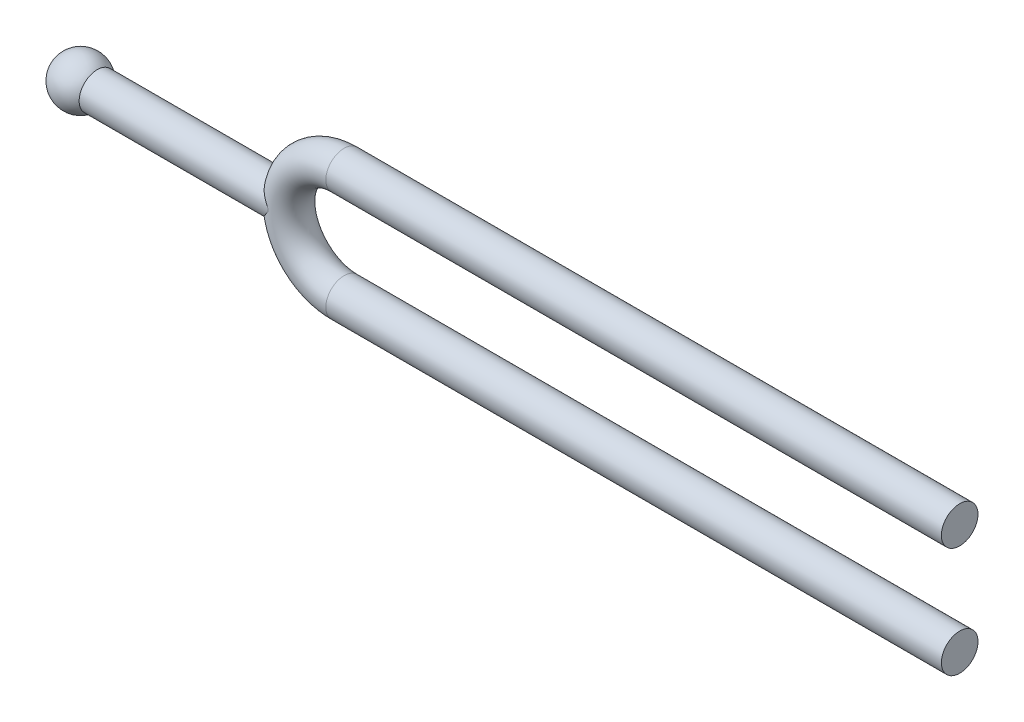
ISO-10303-21;
HEADER;
FILE_DESCRIPTION(('STEP AP214'),'2;1');
FILE_NAME('part.step','',(''),(''),'','','');
FILE_SCHEMA(('AUTOMOTIVE_DESIGN { 1 0 10303 214 1 1 1 1 }'));
ENDSEC;
DATA;
#1=APPLICATION_CONTEXT('core data for automotive mechanical design processes');
#2=APPLICATION_PROTOCOL_DEFINITION('international standard','automotive_design',2000,#1);
#3=PRODUCT_CONTEXT('',#1,'mechanical');
#4=PRODUCT('Part','Part','',(#3));
#5=PRODUCT_RELATED_PRODUCT_CATEGORY('part','',(#4));
#6=PRODUCT_DEFINITION_FORMATION('','',#4);
#7=PRODUCT_DEFINITION_CONTEXT('part definition',#1,'design');
#8=PRODUCT_DEFINITION('design','',#6,#7);
#9=PRODUCT_DEFINITION_SHAPE('','',#8);
#10=(LENGTH_UNIT() NAMED_UNIT(*) SI_UNIT(.MILLI.,.METRE.));
#11=(NAMED_UNIT(*) PLANE_ANGLE_UNIT() SI_UNIT($,.RADIAN.));
#12=(NAMED_UNIT(*) SI_UNIT($,.STERADIAN.) SOLID_ANGLE_UNIT());
#13=UNCERTAINTY_MEASURE_WITH_UNIT(LENGTH_MEASURE(1.E-05),#10,'distance_accuracy_value','');
#14=(GEOMETRIC_REPRESENTATION_CONTEXT(3) GLOBAL_UNCERTAINTY_ASSIGNED_CONTEXT((#13)) GLOBAL_UNIT_ASSIGNED_CONTEXT((#10,
#11,#12)) REPRESENTATION_CONTEXT('',''));
#15=CARTESIAN_POINT('',(0.,0.,0.));
#16=DIRECTION('',(0.,0.,1.));
#17=DIRECTION('',(1.,0.,0.));
#18=AXIS2_PLACEMENT_3D('',#15,#16,#17);
#19=CARTESIAN_POINT('',(0.,0.,0.));
#20=DIRECTION('',(0.,0.,1.));
#21=DIRECTION('',(1.,0.,0.));
#22=AXIS2_PLACEMENT_3D('',#19,#20,#21);
#23=TOROIDAL_SURFACE('',#22,6.7,2.225);
#24=CARTESIAN_POINT('',(0.,-6.7,0.));
#25=DIRECTION('',(-1.,0.,0.));
#26=DIRECTION('',(0.,0.,-1.));
#27=AXIS2_PLACEMENT_3D('',#24,#25,#26);
#28=CIRCLE('',#27,2.225);
#29=CARTESIAN_POINT('',(0.,-6.7,-2.225));
#30=VERTEX_POINT('',#29);
#31=EDGE_CURVE('E40',#30,#30,#28,.T.);
#32=ORIENTED_EDGE('',*,*,#31,.T.);
#33=EDGE_LOOP('',(#32));
#34=FACE_BOUND('',#33,.T.);
#35=CARTESIAN_POINT('',(0.,6.7,0.));
#36=DIRECTION('',(1.,0.,0.));
#37=DIRECTION('',(0.,0.,-1.));
#38=AXIS2_PLACEMENT_3D('',#35,#36,#37);
#39=CIRCLE('',#38,2.225);
#40=CARTESIAN_POINT('',(0.,6.7,-2.225));
#41=VERTEX_POINT('',#40);
#42=EDGE_CURVE('E80',#41,#41,#39,.T.);
#43=ORIENTED_EDGE('',*,*,#42,.F.);
#44=EDGE_LOOP('',(#43));
#45=FACE_BOUND('',#44,.T.);
#46=CARTESIAN_POINT('',(-8.19863687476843,-1.62428287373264,-1.48381439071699));
#47=CARTESIAN_POINT('',(-8.25449629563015,-1.69405624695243,-1.40743184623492));
#48=CARTESIAN_POINT('',(-8.30673740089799,-1.7598489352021,-1.32457770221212));
#49=CARTESIAN_POINT('',(-8.40209657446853,-1.8807210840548,-1.14650504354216));
#50=CARTESIAN_POINT('',(-8.44520717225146,-1.93579176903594,-1.05127650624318));
#51=CARTESIAN_POINT('',(-8.52060144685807,-2.03257849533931,-0.849259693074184));
#52=CARTESIAN_POINT('',(-8.55280608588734,-2.07419695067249,-0.742394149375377));
#53=CARTESIAN_POINT('',(-8.6040658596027,-2.14063855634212,-0.52060296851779));
#54=CARTESIAN_POINT('',(-8.62313488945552,-2.16547945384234,-0.405685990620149));
#55=CARTESIAN_POINT('',(-8.64558505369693,-2.1947482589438,-0.184717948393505));
#56=CARTESIAN_POINT('',(-8.65045376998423,-2.20111145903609,-0.079071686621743));
#57=CARTESIAN_POINT('',(-8.64850836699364,-2.19857120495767,0.131915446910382));
#58=CARTESIAN_POINT('',(-8.64169761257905,-2.18967214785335,0.237256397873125));
#59=CARTESIAN_POINT('',(-8.61761534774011,-2.15829538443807,0.437445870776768));
#60=CARTESIAN_POINT('',(-8.60105745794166,-2.13674424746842,0.532529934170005));
#61=CARTESIAN_POINT('',(-8.5588729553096,-2.08205598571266,0.717159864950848));
#62=CARTESIAN_POINT('',(-8.53324520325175,-2.04891740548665,0.80670503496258));
#63=CARTESIAN_POINT('',(-8.47220602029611,-1.9703954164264,0.983589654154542));
#64=CARTESIAN_POINT('',(-8.43630820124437,-1.92440693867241,1.07049034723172));
#65=CARTESIAN_POINT('',(-8.35686497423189,-1.8232894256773,1.23488857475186));
#66=CARTESIAN_POINT('',(-8.31331698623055,-1.7681573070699,1.31238292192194));
#67=CARTESIAN_POINT('',(-8.20059676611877,-1.62648182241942,1.48723909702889));
#68=CARTESIAN_POINT('',(-8.12824778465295,-1.53633955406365,1.5796818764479));
#69=CARTESIAN_POINT('',(-8.01272385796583,-1.3938617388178,1.70327355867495));
#70=CARTESIAN_POINT('',(-7.97296109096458,-1.34505167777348,1.74202206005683));
#71=CARTESIAN_POINT('',(-7.89146831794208,-1.24544131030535,1.81456986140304));
#72=CARTESIAN_POINT('',(-7.84973889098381,-1.19464159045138,1.84837060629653));
#73=CARTESIAN_POINT('',(-7.75266511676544,-1.07684226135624,1.92000513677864));
#74=CARTESIAN_POINT('',(-7.69680498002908,-1.00932051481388,1.95628050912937));
#75=CARTESIAN_POINT('',(-7.58327780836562,-0.872002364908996,2.0212343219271));
#76=CARTESIAN_POINT('',(-7.52560795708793,-0.802202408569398,2.04990019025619));
#77=CARTESIAN_POINT('',(-7.4099372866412,-0.660670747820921,2.09979883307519));
#78=CARTESIAN_POINT('',(-7.35193832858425,-0.588946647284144,2.12105723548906));
#79=CARTESIAN_POINT('',(-7.26693792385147,-0.478729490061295,2.14761063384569));
#80=CARTESIAN_POINT('',(-7.23897336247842,-0.441603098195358,2.1555656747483));
#81=CARTESIAN_POINT('',(-7.18464381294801,-0.365886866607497,2.16970425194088));
#82=CARTESIAN_POINT('',(-7.15827692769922,-0.327298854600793,2.17588992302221));
#83=CARTESIAN_POINT('',(-7.11753849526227,-0.260932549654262,2.18463397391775));
#84=CARTESIAN_POINT('',(-7.10211388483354,-0.23388035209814,2.18771272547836));
#85=CARTESIAN_POINT('',(-7.0743832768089,-0.178164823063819,2.19295147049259));
#86=CARTESIAN_POINT('',(-7.06206507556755,-0.149508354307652,2.19511508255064));
#87=CARTESIAN_POINT('',(-7.04605392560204,-0.0997608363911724,2.19782893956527));
#88=CARTESIAN_POINT('',(-7.04086181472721,-0.0791901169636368,2.19867405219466));
#89=CARTESIAN_POINT('',(-7.03401337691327,-0.0374688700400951,2.19977916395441));
#90=CARTESIAN_POINT('',(-7.03234767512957,-0.0163200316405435,2.20004071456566));
#91=CARTESIAN_POINT('',(-7.03292571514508,0.0259685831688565,2.19994870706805));
#92=CARTESIAN_POINT('',(-7.03517867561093,0.0471082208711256,2.1995936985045));
#93=CARTESIAN_POINT('',(-7.04310217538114,0.0887389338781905,2.19830870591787));
#94=CARTESIAN_POINT('',(-7.04878244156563,0.10922798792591,2.19737708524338));
#95=CARTESIAN_POINT('',(-7.07180265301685,0.176338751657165,2.19343166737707));
#96=CARTESIAN_POINT('',(-7.09453467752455,0.220928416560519,2.18930436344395));
#97=CARTESIAN_POINT('',(-7.14496806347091,0.307078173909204,2.17889998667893));
#98=CARTESIAN_POINT('',(-7.17271856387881,0.348602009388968,2.17260104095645));
#99=CARTESIAN_POINT('',(-7.22798751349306,0.426700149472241,2.1585557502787));
#100=CARTESIAN_POINT('',(-7.25535342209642,0.463407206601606,2.15096169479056));
#101=CARTESIAN_POINT('',(-7.31083679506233,0.535852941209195,2.1340679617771));
#102=CARTESIAN_POINT('',(-7.33895465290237,0.571591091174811,2.12476737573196));
#103=CARTESIAN_POINT('',(-7.42371207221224,0.677890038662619,2.09425717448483));
#104=CARTESIAN_POINT('',(-7.48069469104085,0.747454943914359,2.07045380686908));
#105=CARTESIAN_POINT('',(-7.59338863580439,0.884309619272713,2.01578463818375));
#106=CARTESIAN_POINT('',(-7.64910412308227,0.951607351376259,1.98494736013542));
#107=CARTESIAN_POINT('',(-7.75849573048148,1.08393475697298,1.91589464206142));
#108=CARTESIAN_POINT('',(-7.81217348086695,1.14896623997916,1.87768525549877));
#109=CARTESIAN_POINT('',(-7.94433070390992,1.30982603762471,1.77141765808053));
#110=CARTESIAN_POINT('',(-8.02099566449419,1.40385029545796,1.69823348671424));
#111=CARTESIAN_POINT('',(-8.16517030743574,1.58226235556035,1.53334991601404));
#112=CARTESIAN_POINT('',(-8.23268753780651,1.66665809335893,1.44166593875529));
#113=CARTESIAN_POINT('',(-8.3444934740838,1.8075578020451,1.25839937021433));
#114=CARTESIAN_POINT('',(-8.39077467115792,1.86634542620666,1.16980043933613));
#115=CARTESIAN_POINT('',(-8.47341980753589,1.97190609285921,0.981437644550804));
#116=CARTESIAN_POINT('',(-8.50978801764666,2.01868430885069,0.881678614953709));
#117=CARTESIAN_POINT('',(-8.57102827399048,2.0977569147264,0.672320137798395));
#118=CARTESIAN_POINT('',(-8.59581764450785,2.12994709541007,0.56265639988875));
#119=CARTESIAN_POINT('',(-8.63197526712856,2.1769830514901,0.337539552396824));
#120=CARTESIAN_POINT('',(-8.64335321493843,2.19184135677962,0.222090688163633));
#121=CARTESIAN_POINT('',(-8.65141892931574,2.20237120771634,0.00393901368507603));
#122=CARTESIAN_POINT('',(-8.64972270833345,2.20015345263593,-0.0986092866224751));
#123=CARTESIAN_POINT('',(-8.63550616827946,2.18160482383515,-0.301633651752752));
#124=CARTESIAN_POINT('',(-8.62298803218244,2.16527679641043,-0.402110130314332));
#125=CARTESIAN_POINT('',(-8.5883267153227,2.12022587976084,-0.595123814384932));
#126=CARTESIAN_POINT('',(-8.56648942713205,2.09189710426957,-0.687809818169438));
#127=CARTESIAN_POINT('',(-8.51422223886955,2.02440903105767,-0.866546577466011));
#128=CARTESIAN_POINT('',(-8.48379007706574,1.98524688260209,-0.952595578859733));
#129=CARTESIAN_POINT('',(-8.41242231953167,1.8939328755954,-1.12394770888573));
#130=CARTESIAN_POINT('',(-8.37079543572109,1.84093805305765,-1.20851060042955));
#131=CARTESIAN_POINT('',(-8.28018949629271,1.72640678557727,-1.36715451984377));
#132=CARTESIAN_POINT('',(-8.23120863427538,1.6648682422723,-1.44123296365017));
#133=CARTESIAN_POINT('',(-8.10375045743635,1.50595925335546,-1.60961178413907));
#134=CARTESIAN_POINT('',(-8.02192539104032,1.40493542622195,-1.69798878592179));
#135=CARTESIAN_POINT('',(-7.89249444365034,1.24667946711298,-1.81386600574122));
#136=CARTESIAN_POINT('',(-7.84811218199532,1.19265952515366,-1.84978117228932));
#137=CARTESIAN_POINT('',(-7.75758030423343,1.08281522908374,-1.91614695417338));
#138=CARTESIAN_POINT('',(-7.71143187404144,1.02699208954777,-1.94660116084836));
#139=CARTESIAN_POINT('',(-7.61689463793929,0.912675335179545,-2.0027902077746));
#140=CARTESIAN_POINT('',(-7.56847933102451,0.854150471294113,-2.02841605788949));
#141=CARTESIAN_POINT('',(-7.47091137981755,0.735437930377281,-2.07441329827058));
#142=CARTESIAN_POINT('',(-7.42175729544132,0.675246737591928,-2.0947724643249));
#143=CARTESIAN_POINT('',(-7.32423958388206,0.55330954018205,-2.13023041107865));
#144=CARTESIAN_POINT('',(-7.27587294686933,0.491575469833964,-2.14536098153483));
#145=CARTESIAN_POINT('',(-7.20620903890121,0.396309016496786,-2.1642488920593));
#146=CARTESIAN_POINT('',(-7.1835118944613,0.36417718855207,-2.16990256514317));
#147=CARTESIAN_POINT('',(-7.1400836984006,0.298438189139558,-2.17991821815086));
#148=CARTESIAN_POINT('',(-7.11934937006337,0.264833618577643,-2.18428237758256));
#149=CARTESIAN_POINT('',(-7.0869981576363,0.204542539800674,-2.19062044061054));
#150=CARTESIAN_POINT('',(-7.07442740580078,0.17841774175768,-2.19292149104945));
#151=CARTESIAN_POINT('',(-7.05330756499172,0.124631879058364,-2.19662985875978));
#152=CARTESIAN_POINT('',(-7.04472794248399,0.0969843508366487,-2.19804399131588));
#153=CARTESIAN_POINT('',(-7.03535299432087,0.0482305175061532,-2.19956617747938));
#154=CARTESIAN_POINT('',(-7.03305894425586,0.02743592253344,-2.19992764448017));
#155=CARTESIAN_POINT('',(-7.03227257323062,-0.0142347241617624,-2.2000525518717));
#156=CARTESIAN_POINT('',(-7.03378074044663,-0.0351107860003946,-2.19981591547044));
#157=CARTESIAN_POINT('',(-7.04113487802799,-0.0819324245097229,-2.19863079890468));
#158=CARTESIAN_POINT('',(-7.04805881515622,-0.107694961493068,-2.19750460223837));
#159=CARTESIAN_POINT('',(-7.06570878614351,-0.157893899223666,-2.19447247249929));
#160=CARTESIAN_POINT('',(-7.07645711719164,-0.182321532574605,-2.1925619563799));
#161=CARTESIAN_POINT('',(-7.10833835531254,-0.246403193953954,-2.18653297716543));
#162=CARTESIAN_POINT('',(-7.13152143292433,-0.284942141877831,-2.18180042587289));
#163=CARTESIAN_POINT('',(-7.18053320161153,-0.360080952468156,-2.1706638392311));
#164=CARTESIAN_POINT('',(-7.20636959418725,-0.396674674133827,-2.16425484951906));
#165=CARTESIAN_POINT('',(-7.25938719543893,-0.468860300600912,-2.14977449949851));
#166=CARTESIAN_POINT('',(-7.28657509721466,-0.50444548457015,-2.14169407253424));
#167=CARTESIAN_POINT('',(-7.34141251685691,-0.574754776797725,-2.12390398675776));
#168=CARTESIAN_POINT('',(-7.36906139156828,-0.609479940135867,-2.1141964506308));
#169=CARTESIAN_POINT('',(-7.45223792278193,-0.712856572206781,-2.08255672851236));
#170=CARTESIAN_POINT('',(-7.50793318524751,-0.78062847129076,-2.05812377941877));
#171=CARTESIAN_POINT('',(-7.6182048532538,-0.914313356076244,-2.00231612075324));
#172=CARTESIAN_POINT('',(-7.67278017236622,-0.980224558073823,-1.9709349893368));
#173=CARTESIAN_POINT('',(-7.77960064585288,-1.10949813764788,-1.90115220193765));
#174=CARTESIAN_POINT('',(-7.8318570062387,-1.17287258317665,-1.86279028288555));
#175=CARTESIAN_POINT('',(-7.93362061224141,-1.29686448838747,-1.77869276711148));
#176=CARTESIAN_POINT('',(-7.98312907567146,-1.35748316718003,-1.73296047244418));
#177=CARTESIAN_POINT('',(-8.06026599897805,-1.45245696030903,-1.65305737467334));
#178=CARTESIAN_POINT('',(-8.0889683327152,-1.48792384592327,-1.621230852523));
#179=CARTESIAN_POINT('',(-8.14493058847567,-1.5573197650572,-1.55469284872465));
#180=CARTESIAN_POINT('',(-8.17218929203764,-1.5912474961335,-1.5199789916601));
#181=CARTESIAN_POINT('',(-8.19863687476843,-1.62428287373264,-1.48381439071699));
#182=B_SPLINE_CURVE_WITH_KNOTS('',3,(#46,#47,#48,#49,#50,#51,#52,#53,#54,#55,#56,#57,#58,#59,
#60,#61,#62,#63,#64,#65,#66,#67,#68,#69,#70,#71,#72,#73,#74,#75,#76,#77,#78,#79,#80,#81,#82,#83,
#84,#85,#86,#87,#88,#89,#90,#91,#92,#93,#94,#95,#96,#97,#98,#99,#100,#101,#102,#103,#104,#105,
#106,#107,#108,#109,#110,#111,#112,#113,#114,#115,#116,#117,#118,#119,#120,#121,#122,#123,#124,
#125,#126,#127,#128,#129,#130,#131,#132,#133,#134,#135,#136,#137,#138,#139,#140,#141,#142,#143,
#144,#145,#146,#147,#148,#149,#150,#151,#152,#153,#154,#155,#156,#157,#158,#159,#160,#161,#162,
#163,#164,#165,#166,#167,#168,#169,#170,#171,#172,#173,#174,#175,#176,#177,#178,#179,#180,#181),
.UNSPECIFIED.,.T.,.F.,(4,2,2,2,2,2,2,2,2,2,2,2,2,2,2,2,2,2,2,2,2,2,2,2,2,2,2,2,2,2,2,2,2,2,2,2,
2,2,2,2,2,2,2,2,2,2,2,2,2,2,2,2,2,2,2,2,2,2,2,2,2,2,2,2,2,2,2,4),(0.,0.352547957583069,
0.705383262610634,1.06072349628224,1.41568726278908,1.731831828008,2.04788532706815,
2.34325900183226,2.63866979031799,2.95143826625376,3.2643124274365,3.70573617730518,
3.92735136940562,4.14890171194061,4.43304350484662,4.71765186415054,5.00126554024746,
5.14269635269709,5.28395579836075,5.37773592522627,5.47114168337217,5.5345983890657,
5.59788618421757,5.66132306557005,5.72494083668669,5.87437678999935,6.02536410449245,
6.16450802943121,6.30372624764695,6.58246737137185,6.86009766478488,7.13750095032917,
7.56089605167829,7.98393964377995,8.33043341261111,8.67677766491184,9.02555845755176,
9.37408694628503,9.68029495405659,9.98644120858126,10.2832298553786,10.5800966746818,
10.9032412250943,11.2264652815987,11.6952956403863,11.9309281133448,12.1664050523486,
12.4066873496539,12.6475224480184,12.88686638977,13.0060556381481,13.1250422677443,
13.2121175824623,13.298515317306,13.3609586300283,13.4234099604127,13.5030198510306,
13.583101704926,13.7184023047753,13.8541073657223,13.9905688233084,14.1268536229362,
14.3997321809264,14.6728640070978,14.9444871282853,15.2159888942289,15.3827700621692,
15.5496898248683),.UNSPECIFIED.);
#183=CARTESIAN_POINT('',(-8.19863687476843,-1.62428287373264,-1.48381439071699));
#184=VERTEX_POINT('',#183);
#185=EDGE_CURVE('E10',#184,#184,#182,.T.);
#186=ORIENTED_EDGE('',*,*,#185,.F.);
#187=EDGE_LOOP('',(#186));
#188=FACE_BOUND('',#187,.T.);
#189=ADVANCED_FACE('F28',(#34,#45,#188),#23,.T.);
#190=CARTESIAN_POINT('',(0.,-6.7,0.));
#191=DIRECTION('',(1.,0.,0.));
#192=DIRECTION('',(0.,0.,-1.));
#193=AXIS2_PLACEMENT_3D('',#190,#191,#192);
#194=CYLINDRICAL_SURFACE('',#193,2.225);
#195=ORIENTED_EDGE('',*,*,#31,.F.);
#196=EDGE_LOOP('',(#195));
#197=FACE_BOUND('',#196,.T.);
#198=CARTESIAN_POINT('',(74.8,-6.7,0.));
#199=DIRECTION('',(-1.,0.,0.));
#200=DIRECTION('',(0.,0.,-1.));
#201=AXIS2_PLACEMENT_3D('',#198,#199,#200);
#202=CIRCLE('',#201,2.225);
#203=CARTESIAN_POINT('',(74.8,-6.7,-2.225));
#204=VERTEX_POINT('',#203);
#205=EDGE_CURVE('E36',#204,#204,#202,.T.);
#206=ORIENTED_EDGE('',*,*,#205,.T.);
#207=EDGE_LOOP('',(#206));
#208=FACE_BOUND('',#207,.T.);
#209=ADVANCED_FACE('F63',(#197,#208),#194,.T.);
#210=CARTESIAN_POINT('',(0.,6.7,0.));
#211=DIRECTION('',(1.,0.,0.));
#212=DIRECTION('',(0.,0.,-1.));
#213=AXIS2_PLACEMENT_3D('',#210,#211,#212);
#214=CYLINDRICAL_SURFACE('',#213,2.225);
#215=ORIENTED_EDGE('',*,*,#42,.T.);
#216=EDGE_LOOP('',(#215));
#217=FACE_BOUND('',#216,.T.);
#218=CARTESIAN_POINT('',(74.8,6.7,0.));
#219=DIRECTION('',(1.,0.,0.));
#220=DIRECTION('',(0.,0.,-1.));
#221=AXIS2_PLACEMENT_3D('',#218,#219,#220);
#222=CIRCLE('',#221,2.225);
#223=CARTESIAN_POINT('',(74.8,6.7,-2.225));
#224=VERTEX_POINT('',#223);
#225=EDGE_CURVE('E81',#224,#224,#222,.T.);
#226=ORIENTED_EDGE('',*,*,#225,.F.);
#227=EDGE_LOOP('',(#226));
#228=FACE_BOUND('',#227,.T.);
#229=ADVANCED_FACE('F60',(#217,#228),#214,.T.);
#230=CARTESIAN_POINT('',(74.8,-6.7,0.));
#231=DIRECTION('',(-1.,0.,0.));
#232=DIRECTION('',(0.,0.,-1.));
#233=AXIS2_PLACEMENT_3D('',#230,#231,#232);
#234=PLANE('',#233);
#235=ORIENTED_EDGE('',*,*,#205,.F.);
#236=EDGE_LOOP('',(#235));
#237=FACE_BOUND('',#236,.T.);
#238=ADVANCED_FACE('F57',(#237),#234,.F.);
#239=CARTESIAN_POINT('',(74.8,6.7,0.));
#240=DIRECTION('',(1.,0.,0.));
#241=DIRECTION('',(0.,0.,-1.));
#242=AXIS2_PLACEMENT_3D('',#239,#240,#241);
#243=PLANE('',#242);
#244=ORIENTED_EDGE('',*,*,#225,.T.);
#245=EDGE_LOOP('',(#244));
#246=FACE_BOUND('',#245,.T.);
#247=ADVANCED_FACE('F53',(#246),#243,.T.);
#248=CARTESIAN_POINT('',(74.801,0.,0.));
#249=DIRECTION('',(-1.,0.,0.));
#250=DIRECTION('',(0.,0.,1.));
#251=AXIS2_PLACEMENT_3D('',#248,#249,#250);
#252=CYLINDRICAL_SURFACE('',#251,2.2);
#253=CARTESIAN_POINT('',(-30.,0.,0.));
#254=DIRECTION('',(1.,0.,0.));
#255=DIRECTION('',(0.,0.,-1.));
#256=AXIS2_PLACEMENT_3D('',#253,#254,#255);
#257=CIRCLE('',#256,2.2);
#258=CARTESIAN_POINT('',(-30.,0.,-2.2));
#259=VERTEX_POINT('',#258);
#260=EDGE_CURVE('E32',#259,#259,#257,.T.);
#261=ORIENTED_EDGE('',*,*,#260,.T.);
#262=EDGE_LOOP('',(#261));
#263=FACE_BOUND('',#262,.T.);
#264=ORIENTED_EDGE('',*,*,#185,.T.);
#265=EDGE_LOOP('',(#264));
#266=FACE_BOUND('',#265,.T.);
#267=ADVANCED_FACE('F49',(#263,#266),#252,.T.);
#268=CARTESIAN_POINT('',(-32.016,0.,0.));
#269=DIRECTION('',(0.,0.,1.));
#270=DIRECTION('',(1.,0.,0.));
#271=AXIS2_PLACEMENT_3D('',#268,#269,#270);
#272=SPHERICAL_SURFACE('',#271,2.984);
#273=CARTESIAN_POINT('',(-32.016,0.,0.));
#274=DIRECTION('',(1.,0.,0.));
#275=DIRECTION('',(0.,0.,-1.));
#276=AXIS2_PLACEMENT_3D('',#273,#274,#275);
#277=SPHERICAL_SURFACE('',#276,2.984);
#278=ORIENTED_EDGE('',*,*,#260,.F.);
#279=EDGE_LOOP('',(#278));
#280=FACE_BOUND('',#279,.T.);
#281=ADVANCED_FACE('F30',(#280),#277,.T.);
#282=CLOSED_SHELL('',(#189,#209,#229,#238,#247,#267,#281));
#283=MANIFOLD_SOLID_BREP('B2',#282);
#284=ADVANCED_BREP_SHAPE_REPRESENTATION('',(#18,#283),#14);
#285=SHAPE_DEFINITION_REPRESENTATION(#9,#284);
ENDSEC;
END-ISO-10303-21;
